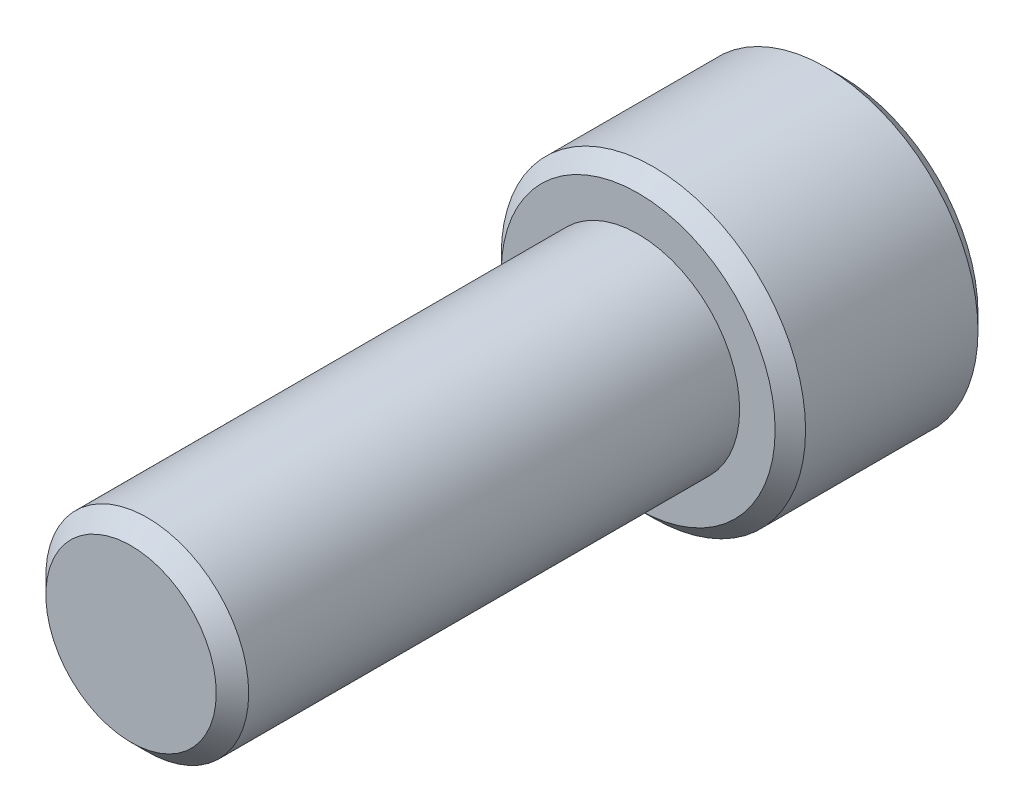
ISO-10303-21;
HEADER;
FILE_DESCRIPTION(('STEP AP214'),'2;1');
FILE_NAME('part.step','',(''),(''),'','','');
FILE_SCHEMA(('AUTOMOTIVE_DESIGN { 1 0 10303 214 1 1 1 1 }'));
ENDSEC;
DATA;
#1=APPLICATION_CONTEXT('core data for automotive mechanical design processes');
#2=APPLICATION_PROTOCOL_DEFINITION('international standard','automotive_design',2000,#1);
#3=PRODUCT_CONTEXT('',#1,'mechanical');
#4=PRODUCT('Part','Part','',(#3));
#5=PRODUCT_RELATED_PRODUCT_CATEGORY('part','',(#4));
#6=PRODUCT_DEFINITION_FORMATION('','',#4);
#7=PRODUCT_DEFINITION_CONTEXT('part definition',#1,'design');
#8=PRODUCT_DEFINITION('design','',#6,#7);
#9=PRODUCT_DEFINITION_SHAPE('','',#8);
#10=(LENGTH_UNIT() NAMED_UNIT(*) SI_UNIT(.MILLI.,.METRE.));
#11=(NAMED_UNIT(*) PLANE_ANGLE_UNIT() SI_UNIT($,.RADIAN.));
#12=(NAMED_UNIT(*) SI_UNIT($,.STERADIAN.) SOLID_ANGLE_UNIT());
#13=UNCERTAINTY_MEASURE_WITH_UNIT(LENGTH_MEASURE(1.E-05),#10,'distance_accuracy_value','');
#14=(GEOMETRIC_REPRESENTATION_CONTEXT(3) GLOBAL_UNCERTAINTY_ASSIGNED_CONTEXT((#13)) GLOBAL_UNIT_ASSIGNED_CONTEXT((#10,
#11,#12)) REPRESENTATION_CONTEXT('',''));
#15=CARTESIAN_POINT('',(0.,0.,0.));
#16=DIRECTION('',(0.,0.,1.));
#17=DIRECTION('',(1.,0.,0.));
#18=AXIS2_PLACEMENT_3D('',#15,#16,#17);
#19=CARTESIAN_POINT('',(0.,0.,-15.875));
#20=DIRECTION('',(0.,0.,1.));
#21=DIRECTION('',(1.,0.,0.));
#22=AXIS2_PLACEMENT_3D('',#19,#20,#21);
#23=CYLINDRICAL_SURFACE('',#22,3.175);
#24=CARTESIAN_POINT('',(0.,0.,-0.508000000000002));
#25=DIRECTION('',(0.,0.,1.));
#26=DIRECTION('',(1.,0.,0.));
#27=AXIS2_PLACEMENT_3D('',#24,#25,#26);
#28=CIRCLE('',#27,3.175);
#29=CARTESIAN_POINT('',(3.175,0.,-0.508000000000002));
#30=VERTEX_POINT('',#29);
#31=EDGE_CURVE('E11',#30,#30,#28,.F.);
#32=ORIENTED_EDGE('',*,*,#31,.T.);
#33=EDGE_LOOP('',(#32));
#34=FACE_BOUND('',#33,.T.);
#35=CARTESIAN_POINT('',(0.,0.,-15.875));
#36=DIRECTION('',(0.,0.,-1.));
#37=DIRECTION('',(-1.,0.,0.));
#38=AXIS2_PLACEMENT_3D('',#35,#36,#37);
#39=CIRCLE('',#38,3.175);
#40=CARTESIAN_POINT('',(-3.175,0.,-15.875));
#41=VERTEX_POINT('',#40);
#42=EDGE_CURVE('E107',#41,#41,#39,.F.);
#43=ORIENTED_EDGE('',*,*,#42,.T.);
#44=EDGE_LOOP('',(#43));
#45=FACE_BOUND('',#44,.T.);
#46=ADVANCED_FACE('F33',(#34,#45),#23,.T.);
#47=CARTESIAN_POINT('',(0.,0.,0.));
#48=DIRECTION('',(0.,0.,1.));
#49=DIRECTION('',(1.,0.,0.));
#50=AXIS2_PLACEMENT_3D('',#47,#48,#49);
#51=PLANE('',#50);
#52=CARTESIAN_POINT('',(0.,0.,0.));
#53=DIRECTION('',(0.,0.,1.));
#54=DIRECTION('',(1.,0.,0.));
#55=AXIS2_PLACEMENT_3D('',#52,#53,#54);
#56=CIRCLE('',#55,2.667);
#57=CARTESIAN_POINT('',(2.667,0.,0.));
#58=VERTEX_POINT('',#57);
#59=EDGE_CURVE('E41',#58,#58,#56,.T.);
#60=ORIENTED_EDGE('',*,*,#59,.T.);
#61=EDGE_LOOP('',(#60));
#62=FACE_BOUND('',#61,.T.);
#63=ADVANCED_FACE('F177',(#62),#51,.T.);
#64=CARTESIAN_POINT('',(0.,0.,-22.225));
#65=DIRECTION('',(0.,0.,1.));
#66=DIRECTION('',(1.,0.,0.));
#67=AXIS2_PLACEMENT_3D('',#64,#65,#66);
#68=CYLINDRICAL_SURFACE('',#67,4.7625);
#69=CARTESIAN_POINT('',(0.,0.,-21.74875));
#70=DIRECTION('',(0.,0.,-1.));
#71=DIRECTION('',(-1.,0.,0.));
#72=AXIS2_PLACEMENT_3D('',#69,#70,#71);
#73=CIRCLE('',#72,4.7625);
#74=CARTESIAN_POINT('',(4.7625,0.,-21.74875));
#75=VERTEX_POINT('',#74);
#76=EDGE_CURVE('E169',#75,#75,#73,.F.);
#77=CARTESIAN_POINT('',(0.,0.,-16.35125));
#78=DIRECTION('',(0.,0.,-1.));
#79=DIRECTION('',(-1.,0.,0.));
#80=AXIS2_PLACEMENT_3D('',#77,#78,#79);
#81=CIRCLE('',#80,4.7625);
#82=CARTESIAN_POINT('',(4.7625,0.,-16.35125));
#83=VERTEX_POINT('',#82);
#84=EDGE_CURVE('E166',#83,#83,#81,.T.);
#85=CARTESIAN_POINT('',(4.7625,0.,-21.74875));
#86=CARTESIAN_POINT('',(4.7625,0.,-21.6925260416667));
#87=CARTESIAN_POINT('',(4.7625,0.,-21.6363020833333));
#88=CARTESIAN_POINT('',(4.7625,0.,-21.5238541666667));
#89=CARTESIAN_POINT('',(4.7625,0.,-21.4676302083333));
#90=CARTESIAN_POINT('',(4.7625,0.,-21.3551822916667));
#91=CARTESIAN_POINT('',(4.7625,0.,-21.2989583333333));
#92=CARTESIAN_POINT('',(4.7625,0.,-21.1865104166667));
#93=CARTESIAN_POINT('',(4.7625,0.,-21.1302864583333));
#94=CARTESIAN_POINT('',(4.7625,0.,-21.0178385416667));
#95=CARTESIAN_POINT('',(4.7625,0.,-20.9616145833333));
#96=CARTESIAN_POINT('',(4.7625,0.,-20.8491666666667));
#97=CARTESIAN_POINT('',(4.7625,0.,-20.7929427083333));
#98=CARTESIAN_POINT('',(4.7625,0.,-20.6804947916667));
#99=CARTESIAN_POINT('',(4.7625,0.,-20.6242708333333));
#100=CARTESIAN_POINT('',(4.7625,0.,-20.5118229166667));
#101=CARTESIAN_POINT('',(4.7625,0.,-20.4555989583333));
#102=CARTESIAN_POINT('',(4.7625,0.,-20.3431510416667));
#103=CARTESIAN_POINT('',(4.7625,0.,-20.2869270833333));
#104=CARTESIAN_POINT('',(4.7625,0.,-20.1744791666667));
#105=CARTESIAN_POINT('',(4.7625,0.,-20.1182552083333));
#106=CARTESIAN_POINT('',(4.7625,0.,-20.0058072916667));
#107=CARTESIAN_POINT('',(4.7625,0.,-19.9495833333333));
#108=CARTESIAN_POINT('',(4.7625,0.,-19.8371354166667));
#109=CARTESIAN_POINT('',(4.7625,0.,-19.7809114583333));
#110=CARTESIAN_POINT('',(4.7625,0.,-19.6684635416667));
#111=CARTESIAN_POINT('',(4.7625,0.,-19.6122395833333));
#112=CARTESIAN_POINT('',(4.7625,0.,-19.4997916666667));
#113=CARTESIAN_POINT('',(4.7625,0.,-19.4435677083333));
#114=CARTESIAN_POINT('',(4.7625,0.,-19.3311197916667));
#115=CARTESIAN_POINT('',(4.7625,0.,-19.2748958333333));
#116=CARTESIAN_POINT('',(4.7625,0.,-19.1624479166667));
#117=CARTESIAN_POINT('',(4.7625,0.,-19.1062239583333));
#118=CARTESIAN_POINT('',(4.7625,0.,-18.9937760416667));
#119=CARTESIAN_POINT('',(4.7625,0.,-18.9375520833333));
#120=CARTESIAN_POINT('',(4.7625,0.,-18.8251041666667));
#121=CARTESIAN_POINT('',(4.7625,0.,-18.7688802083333));
#122=CARTESIAN_POINT('',(4.7625,0.,-18.6564322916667));
#123=CARTESIAN_POINT('',(4.7625,0.,-18.6002083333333));
#124=CARTESIAN_POINT('',(4.7625,0.,-18.4877604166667));
#125=CARTESIAN_POINT('',(4.7625,0.,-18.4315364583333));
#126=CARTESIAN_POINT('',(4.7625,0.,-18.3190885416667));
#127=CARTESIAN_POINT('',(4.7625,0.,-18.2628645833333));
#128=CARTESIAN_POINT('',(4.7625,0.,-18.1504166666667));
#129=CARTESIAN_POINT('',(4.7625,0.,-18.0941927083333));
#130=CARTESIAN_POINT('',(4.7625,0.,-17.9817447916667));
#131=CARTESIAN_POINT('',(4.7625,0.,-17.9255208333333));
#132=CARTESIAN_POINT('',(4.7625,0.,-17.8130729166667));
#133=CARTESIAN_POINT('',(4.7625,0.,-17.7568489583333));
#134=CARTESIAN_POINT('',(4.7625,0.,-17.6444010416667));
#135=CARTESIAN_POINT('',(4.7625,0.,-17.5881770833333));
#136=CARTESIAN_POINT('',(4.7625,0.,-17.4757291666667));
#137=CARTESIAN_POINT('',(4.7625,0.,-17.4195052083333));
#138=CARTESIAN_POINT('',(4.7625,0.,-17.3070572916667));
#139=CARTESIAN_POINT('',(4.7625,0.,-17.2508333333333));
#140=CARTESIAN_POINT('',(4.7625,0.,-17.1383854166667));
#141=CARTESIAN_POINT('',(4.7625,0.,-17.0821614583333));
#142=CARTESIAN_POINT('',(4.7625,0.,-16.9697135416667));
#143=CARTESIAN_POINT('',(4.7625,0.,-16.9134895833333));
#144=CARTESIAN_POINT('',(4.7625,0.,-16.8010416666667));
#145=CARTESIAN_POINT('',(4.7625,0.,-16.7448177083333));
#146=CARTESIAN_POINT('',(4.7625,0.,-16.6323697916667));
#147=CARTESIAN_POINT('',(4.7625,0.,-16.5761458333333));
#148=CARTESIAN_POINT('',(4.7625,0.,-16.4636979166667));
#149=CARTESIAN_POINT('',(4.7625,0.,-16.4074739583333));
#150=CARTESIAN_POINT('',(4.7625,0.,-16.35125));
#151=B_SPLINE_CURVE_WITH_KNOTS('',3,(#85,#86,#87,#88,#89,#90,#91,#92,#93,#94,#95,#96,#97,#98,
#99,#100,#101,#102,#103,#104,#105,#106,#107,#108,#109,#110,#111,#112,#113,#114,#115,#116,#117,
#118,#119,#120,#121,#122,#123,#124,#125,#126,#127,#128,#129,#130,#131,#132,#133,#134,#135,#136,
#137,#138,#139,#140,#141,#142,#143,#144,#145,#146,#147,#148,#149,#150),.UNSPECIFIED.,.F.,.F.,(4,
2,2,2,2,2,2,2,2,2,2,2,2,2,2,2,2,2,2,2,2,2,2,2,2,2,2,2,2,2,2,2,4),(0.,0.168671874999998,
0.337343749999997,0.506015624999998,0.6746875,0.843359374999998,1.01203125,1.180703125,1.349375,
1.518046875,1.68671875,1.855390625,2.0240625,2.192734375,2.36140625,2.530078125,2.69875,
2.867421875,3.03609375,3.204765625,3.3734375,3.542109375,3.71078125,3.879453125,4.048125,
4.216796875,4.38546875,4.554140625,4.7228125,4.891484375,5.06015625,5.228828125,5.3975),.UNSPECIFIED.);
#152=EDGE_CURVE('BSEAM194',#75,#83,#151,.T.);
#153=ORIENTED_EDGE('',*,*,#76,.T.);
#154=ORIENTED_EDGE('',*,*,#84,.T.);
#155=ORIENTED_EDGE('',*,*,#152,.T.);
#156=ORIENTED_EDGE('',*,*,#152,.F.);
#157=EDGE_LOOP('',(#153,#155,#154,#156));
#158=FACE_BOUND('',#157,.T.);
#159=ADVANCED_FACE('F194',(#158),#68,.T.);
#160=CARTESIAN_POINT('',(0.,0.,-22.225));
#161=DIRECTION('',(0.,0.,-1.));
#162=DIRECTION('',(-1.,0.,0.));
#163=AXIS2_PLACEMENT_3D('',#160,#161,#162);
#164=PLANE('',#163);
#165=CARTESIAN_POINT('',(0.,0.,-22.225));
#166=DIRECTION('',(0.,0.,-1.));
#167=DIRECTION('',(-1.,0.,0.));
#168=AXIS2_PLACEMENT_3D('',#165,#166,#167);
#169=CIRCLE('',#168,4.28625);
#170=CARTESIAN_POINT('',(4.28625,0.,-22.225));
#171=VERTEX_POINT('',#170);
#172=EDGE_CURVE('E106',#171,#171,#169,.T.);
#173=ORIENTED_EDGE('',*,*,#172,.T.);
#174=EDGE_LOOP('',(#173));
#175=FACE_BOUND('',#174,.T.);
#176=CARTESIAN_POINT('',(0.,0.,-22.225));
#177=DIRECTION('',(0.,0.,-1.));
#178=DIRECTION('',(-1.,0.,0.));
#179=AXIS2_PLACEMENT_3D('',#176,#177,#178);
#180=CIRCLE('',#179,2.74963065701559);
#181=CARTESIAN_POINT('',(-2.38125,1.37481532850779,-22.225));
#182=VERTEX_POINT('',#181);
#183=CARTESIAN_POINT('',(0.,2.74963065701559,-22.225));
#184=VERTEX_POINT('',#183);
#185=EDGE_CURVE('E87',#182,#184,#180,.T.);
#186=ORIENTED_EDGE('',*,*,#185,.F.);
#187=CARTESIAN_POINT('',(-2.38125,-1.3748153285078,-22.225));
#188=VERTEX_POINT('',#187);
#189=EDGE_CURVE('E47',#188,#182,#180,.T.);
#190=ORIENTED_EDGE('',*,*,#189,.F.);
#191=CARTESIAN_POINT('',(0.,-2.74963065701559,-22.225));
#192=VERTEX_POINT('',#191);
#193=EDGE_CURVE('E401',#192,#188,#180,.T.);
#194=ORIENTED_EDGE('',*,*,#193,.F.);
#195=CARTESIAN_POINT('',(2.38125,-1.3748153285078,-22.225));
#196=VERTEX_POINT('',#195);
#197=EDGE_CURVE('E54',#196,#192,#180,.T.);
#198=ORIENTED_EDGE('',*,*,#197,.F.);
#199=CARTESIAN_POINT('',(2.38125,1.3748153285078,-22.225));
#200=VERTEX_POINT('',#199);
#201=EDGE_CURVE('E128',#200,#196,#180,.T.);
#202=ORIENTED_EDGE('',*,*,#201,.F.);
#203=EDGE_CURVE('E96',#184,#200,#180,.T.);
#204=ORIENTED_EDGE('',*,*,#203,.F.);
#205=EDGE_LOOP('',(#186,#190,#194,#198,#202,#204));
#206=FACE_BOUND('',#205,.T.);
#207=ADVANCED_FACE('F127',(#175,#206),#164,.T.);
#208=CARTESIAN_POINT('',(0.,0.,-15.875));
#209=DIRECTION('',(0.,0.,-1.));
#210=DIRECTION('',(-1.,0.,0.));
#211=AXIS2_PLACEMENT_3D('',#208,#209,#210);
#212=PLANE('',#211);
#213=CARTESIAN_POINT('',(0.,0.,-15.875));
#214=DIRECTION('',(0.,0.,-1.));
#215=DIRECTION('',(-1.,0.,0.));
#216=AXIS2_PLACEMENT_3D('',#213,#214,#215);
#217=CIRCLE('',#216,4.28625);
#218=CARTESIAN_POINT('',(-4.28625,0.,-15.875));
#219=VERTEX_POINT('',#218);
#220=EDGE_CURVE('E172',#219,#219,#217,.F.);
#221=ORIENTED_EDGE('',*,*,#220,.T.);
#222=EDGE_LOOP('',(#221));
#223=FACE_BOUND('',#222,.T.);
#224=ORIENTED_EDGE('',*,*,#42,.F.);
#225=EDGE_LOOP('',(#224));
#226=FACE_BOUND('',#225,.T.);
#227=ADVANCED_FACE('F210',(#223,#226),#212,.F.);
#228=CARTESIAN_POINT('',(0.,0.,-22.225));
#229=DIRECTION('',(0.,0.,-1.));
#230=DIRECTION('',(-1.,0.,0.));
#231=AXIS2_PLACEMENT_3D('',#228,#229,#230);
#232=CONICAL_SURFACE('',#231,2.74963065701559,0.78539816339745);
#233=ORIENTED_EDGE('',*,*,#203,.T.);
#234=CARTESIAN_POINT('',(-0.000199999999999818,2.74974612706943,-22.2251154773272));
#235=CARTESIAN_POINT('',(0.0816567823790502,2.70248609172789,-22.1778948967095));
#236=CARTESIAN_POINT('',(0.16488233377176,2.65443579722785,-22.1334475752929));
#237=CARTESIAN_POINT('',(0.33458848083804,2.556455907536,-22.0520654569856));
#238=CARTESIAN_POINT('',(0.421085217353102,2.50651699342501,-22.0151759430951));
#239=CARTESIAN_POINT('',(0.595501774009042,2.40581754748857,-21.9519834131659));
#240=CARTESIAN_POINT('',(0.683377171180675,2.35508266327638,-21.9255215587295));
#241=CARTESIAN_POINT('',(0.861062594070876,2.25249593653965,-21.8847515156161));
#242=CARTESIAN_POINT('',(0.950867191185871,2.20064722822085,-21.8704128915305));
#243=CARTESIAN_POINT('',(1.10563960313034,2.11128933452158,-21.8574757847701));
#244=CARTESIAN_POINT('',(1.17040744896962,2.07389560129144,-21.8555606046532));
#245=CARTESIAN_POINT('',(1.29983727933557,1.99916925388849,-21.8587866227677));
#246=CARTESIAN_POINT('',(1.36449921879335,1.96183666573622,-21.8639302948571));
#247=CARTESIAN_POINT('',(1.4932125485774,1.88752399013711,-21.8809813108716));
#248=CARTESIAN_POINT('',(1.55726317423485,1.85054434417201,-21.8928962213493));
#249=CARTESIAN_POINT('',(1.68425683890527,1.77722451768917,-21.922835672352));
#250=CARTESIAN_POINT('',(1.74719996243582,1.74088428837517,-21.9408597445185));
#251=CARTESIAN_POINT('',(1.90842615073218,1.64780030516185,-21.9943688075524));
#252=CARTESIAN_POINT('',(2.00570949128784,1.59163374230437,-22.0338874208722));
#253=CARTESIAN_POINT('',(2.14875606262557,1.50904576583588,-22.1006003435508));
#254=CARTESIAN_POINT('',(2.19589628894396,1.4818293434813,-22.1240402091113));
#255=CARTESIAN_POINT('',(2.28930352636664,1.42790064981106,-22.1730566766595));
#256=CARTESIAN_POINT('',(2.33557105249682,1.40118808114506,-22.1986319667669));
#257=CARTESIAN_POINT('',(2.38145,1.37469985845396,-22.2251154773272));
#258=B_SPLINE_CURVE_WITH_KNOTS('',3,(#234,#235,#236,#237,#238,#239,#240,#241,#242,#243,#244,
#245,#246,#247,#248,#249,#250,#251,#252,#253,#254,#255,#256,#257),.UNSPECIFIED.,.F.,.F.,(4,2,2,
2,2,2,2,2,2,2,2,4),(0.,0.317196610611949,0.636241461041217,0.950218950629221,1.26340583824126,
1.48752413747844,1.71172100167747,1.93616888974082,2.16059957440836,2.51709639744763,
2.69486147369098,2.87251813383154),.UNSPECIFIED.);
#259=EDGE_CURVE('E101',#184,#200,#258,.T.);
#260=ORIENTED_EDGE('',*,*,#259,.F.);
#261=EDGE_LOOP('',(#233,#260));
#262=FACE_BOUND('',#261,.T.);
#263=ADVANCED_FACE('F102',(#262),#232,.F.);
#264=ORIENTED_EDGE('',*,*,#201,.T.);
#265=CARTESIAN_POINT('',(2.38125,-2.74194290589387,-23.1069808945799));
#266=CARTESIAN_POINT('',(2.38125,-2.6751796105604,-23.0565846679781));
#267=CARTESIAN_POINT('',(2.38125,-2.60804251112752,-23.0066755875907));
#268=CARTESIAN_POINT('',(2.38125,-2.47287325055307,-22.9080498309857));
#269=CARTESIAN_POINT('',(2.38125,-2.40484086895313,-22.8593334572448));
#270=CARTESIAN_POINT('',(2.38125,-2.26723593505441,-22.7629648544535));
#271=CARTESIAN_POINT('',(2.38125,-2.1976555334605,-22.7153237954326));
#272=CARTESIAN_POINT('',(2.38125,-2.05731367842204,-22.6218199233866));
#273=CARTESIAN_POINT('',(2.38125,-1.98655230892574,-22.5759569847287));
#274=CARTESIAN_POINT('',(2.38125,-1.83957751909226,-22.4838459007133));
#275=CARTESIAN_POINT('',(2.38125,-1.76328361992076,-22.4377255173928));
#276=CARTESIAN_POINT('',(2.38125,-1.6089135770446,-22.3485183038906));
#277=CARTESIAN_POINT('',(2.38125,-1.53083712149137,-22.3054320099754));
#278=CARTESIAN_POINT('',(2.38125,-1.37291620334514,-22.2232265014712));
#279=CARTESIAN_POINT('',(2.38125,-1.29307799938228,-22.1840953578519));
#280=CARTESIAN_POINT('',(2.38125,-1.13121425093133,-22.1106679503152));
#281=CARTESIAN_POINT('',(2.38125,-1.04918943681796,-22.0763700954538));
#282=CARTESIAN_POINT('',(2.38125,-0.889535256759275,-22.0163546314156));
#283=CARTESIAN_POINT('',(2.38125,-0.812083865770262,-21.990168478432));
#284=CARTESIAN_POINT('',(2.38125,-0.655316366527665,-21.9440097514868));
#285=CARTESIAN_POINT('',(2.38125,-0.576000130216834,-21.9240376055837));
#286=CARTESIAN_POINT('',(2.38125,-0.417295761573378,-21.8916821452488));
#287=CARTESIAN_POINT('',(2.38125,-0.337934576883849,-21.8791688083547));
#288=CARTESIAN_POINT('',(2.38125,-0.178363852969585,-21.8619738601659));
#289=CARTESIAN_POINT('',(2.38125,-0.0981544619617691,-21.8572909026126));
#290=CARTESIAN_POINT('',(2.38125,0.059418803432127,-21.8561044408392));
#291=CARTESIAN_POINT('',(2.38125,0.136780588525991,-21.8593110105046));
#292=CARTESIAN_POINT('',(2.38125,0.290840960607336,-21.8730870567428));
#293=CARTESIAN_POINT('',(2.38125,0.367539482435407,-21.8836572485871));
#294=CARTESIAN_POINT('',(2.38125,0.521017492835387,-21.9117628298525));
#295=CARTESIAN_POINT('',(2.38125,0.597774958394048,-21.9294167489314));
#296=CARTESIAN_POINT('',(2.38125,0.74960981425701,-21.9707513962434));
#297=CARTESIAN_POINT('',(2.38125,0.824687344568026,-21.9944316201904));
#298=CARTESIAN_POINT('',(2.38125,1.06107814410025,-22.077894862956));
#299=CARTESIAN_POINT('',(2.38125,1.2190478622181,-22.1471839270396));
#300=CARTESIAN_POINT('',(2.38125,1.45021000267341,-22.2626640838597));
#301=CARTESIAN_POINT('',(2.38125,1.52644290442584,-22.3031730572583));
#302=CARTESIAN_POINT('',(2.38125,1.67717618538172,-22.3873026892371));
#303=CARTESIAN_POINT('',(2.38125,1.75167687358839,-22.4309227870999));
#304=CARTESIAN_POINT('',(2.38125,1.89548152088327,-22.518412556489));
#305=CARTESIAN_POINT('',(2.38125,1.96485959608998,-22.5621617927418));
#306=CARTESIAN_POINT('',(2.38125,2.10242624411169,-22.6515011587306));
#307=CARTESIAN_POINT('',(2.38125,2.17061472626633,-22.697091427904));
#308=CARTESIAN_POINT('',(2.38125,2.30540317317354,-22.7894060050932));
#309=CARTESIAN_POINT('',(2.38125,2.37201154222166,-22.8361180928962));
#310=CARTESIAN_POINT('',(2.38125,2.50431800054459,-22.9307775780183));
#311=CARTESIAN_POINT('',(2.38125,2.57001633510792,-22.9787246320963));
#312=CARTESIAN_POINT('',(2.38125,2.63533378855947,-23.0271767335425));
#313=B_SPLINE_CURVE_WITH_KNOTS('',3,(#265,#266,#267,#268,#269,#270,#271,#272,#273,#274,#275,
#276,#277,#278,#279,#280,#281,#282,#283,#284,#285,#286,#287,#288,#289,#290,#291,#292,#293,#294,
#295,#296,#297,#298,#299,#300,#301,#302,#303,#304,#305,#306,#307,#308,#309,#310,#311,#312),
.UNSPECIFIED.,.F.,.F.,(4,2,2,2,2,2,2,2,2,2,2,2,2,2,2,2,2,2,2,2,2,2,2,4),(0.,0.250951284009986,
0.501965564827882,0.754924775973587,1.00786608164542,1.27526207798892,1.54270521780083,
1.80931602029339,2.07583885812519,2.32089852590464,2.56597507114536,2.80664400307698,
3.04727155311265,3.27918940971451,3.51112979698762,3.74712477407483,3.98310000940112,
4.49898139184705,4.75794323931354,5.01685853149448,5.26288960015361,5.50893933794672,
5.75299038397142,5.9969743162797),.UNSPECIFIED.);
#314=EDGE_CURVE('E95',#200,#196,#313,.F.);
#315=ORIENTED_EDGE('',*,*,#314,.F.);
#316=EDGE_LOOP('',(#264,#315));
#317=FACE_BOUND('',#316,.T.);
#318=ADVANCED_FACE('F277',(#317),#232,.F.);
#319=ORIENTED_EDGE('',*,*,#197,.T.);
#320=CARTESIAN_POINT('',(2.38145,-1.37469985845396,-22.2251154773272));
#321=CARTESIAN_POINT('',(2.29959321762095,-1.4219598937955,-22.1778948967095));
#322=CARTESIAN_POINT('',(2.21636766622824,-1.47001018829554,-22.1334475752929));
#323=CARTESIAN_POINT('',(2.04666151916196,-1.56799007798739,-22.0520654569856));
#324=CARTESIAN_POINT('',(1.9601647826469,-1.61792899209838,-22.0151759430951));
#325=CARTESIAN_POINT('',(1.78574822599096,-1.71862843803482,-21.9519834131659));
#326=CARTESIAN_POINT('',(1.69787282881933,-1.769363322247,-21.9255215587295));
#327=CARTESIAN_POINT('',(1.52018740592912,-1.87195004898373,-21.8847515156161));
#328=CARTESIAN_POINT('',(1.43038280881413,-1.92379875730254,-21.8704128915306));
#329=CARTESIAN_POINT('',(1.27561039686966,-2.01315665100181,-21.8574757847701));
#330=CARTESIAN_POINT('',(1.21084255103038,-2.05055038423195,-21.8555606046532));
#331=CARTESIAN_POINT('',(1.08141272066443,-2.1252767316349,-21.8587866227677));
#332=CARTESIAN_POINT('',(1.01675078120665,-2.16260931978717,-21.8639302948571));
#333=CARTESIAN_POINT('',(0.888037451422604,-2.23692199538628,-21.8809813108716));
#334=CARTESIAN_POINT('',(0.823986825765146,-2.27390164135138,-21.8928962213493));
#335=CARTESIAN_POINT('',(0.696993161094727,-2.34722146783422,-21.922835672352));
#336=CARTESIAN_POINT('',(0.634050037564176,-2.38356169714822,-21.9408597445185));
#337=CARTESIAN_POINT('',(0.472823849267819,-2.47664568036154,-21.9943688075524));
#338=CARTESIAN_POINT('',(0.37554050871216,-2.53281224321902,-22.0338874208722));
#339=CARTESIAN_POINT('',(0.232493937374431,-2.61540021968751,-22.1006003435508));
#340=CARTESIAN_POINT('',(0.185353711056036,-2.6426166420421,-22.1240402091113));
#341=CARTESIAN_POINT('',(0.0919464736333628,-2.69654533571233,-22.1730566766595));
#342=CARTESIAN_POINT('',(0.0456789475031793,-2.72325790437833,-22.1986319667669));
#343=CARTESIAN_POINT('',(-0.000199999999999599,-2.74974612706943,-22.2251154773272));
#344=B_SPLINE_CURVE_WITH_KNOTS('',3,(#320,#321,#322,#323,#324,#325,#326,#327,#328,#329,#330,
#331,#332,#333,#334,#335,#336,#337,#338,#339,#340,#341,#342,#343),.UNSPECIFIED.,.F.,.F.,(4,2,2,
2,2,2,2,2,2,2,2,4),(0.,0.31719661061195,0.636241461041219,0.950218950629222,1.26340583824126,
1.48752413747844,1.71172100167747,1.93616888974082,2.16059957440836,2.51709639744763,
2.69486147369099,2.87251813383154),.UNSPECIFIED.);
#345=EDGE_CURVE('E137',#196,#192,#344,.T.);
#346=ORIENTED_EDGE('',*,*,#345,.F.);
#347=EDGE_LOOP('',(#319,#346));
#348=FACE_BOUND('',#347,.T.);
#349=ADVANCED_FACE('F269',(#348),#232,.F.);
#350=ORIENTED_EDGE('',*,*,#193,.T.);
#351=CARTESIAN_POINT('',(0.000200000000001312,-2.74974612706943,-22.2251154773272));
#352=CARTESIAN_POINT('',(-0.0816567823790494,-2.70248609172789,-22.1778948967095));
#353=CARTESIAN_POINT('',(-0.164882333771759,-2.65443579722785,-22.1334475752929));
#354=CARTESIAN_POINT('',(-0.334588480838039,-2.556455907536,-22.0520654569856));
#355=CARTESIAN_POINT('',(-0.421085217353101,-2.50651699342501,-22.0151759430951));
#356=CARTESIAN_POINT('',(-0.595501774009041,-2.40581754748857,-21.9519834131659));
#357=CARTESIAN_POINT('',(-0.683377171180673,-2.35508266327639,-21.9255215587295));
#358=CARTESIAN_POINT('',(-0.861062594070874,-2.25249593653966,-21.8847515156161));
#359=CARTESIAN_POINT('',(-0.95086719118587,-2.20064722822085,-21.8704128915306));
#360=CARTESIAN_POINT('',(-1.10563960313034,-2.11128933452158,-21.8574757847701));
#361=CARTESIAN_POINT('',(-1.17040744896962,-2.07389560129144,-21.8555606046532));
#362=CARTESIAN_POINT('',(-1.29983727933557,-1.99916925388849,-21.8587866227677));
#363=CARTESIAN_POINT('',(-1.36449921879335,-1.96183666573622,-21.8639302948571));
#364=CARTESIAN_POINT('',(-1.4932125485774,-1.88752399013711,-21.8809813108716));
#365=CARTESIAN_POINT('',(-1.55726317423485,-1.85054434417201,-21.8928962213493));
#366=CARTESIAN_POINT('',(-1.68425683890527,-1.77722451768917,-21.922835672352));
#367=CARTESIAN_POINT('',(-1.74719996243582,-1.74088428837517,-21.9408597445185));
#368=CARTESIAN_POINT('',(-1.90842615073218,-1.64780030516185,-21.9943688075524));
#369=CARTESIAN_POINT('',(-2.00570949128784,-1.59163374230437,-22.0338874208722));
#370=CARTESIAN_POINT('',(-2.14875606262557,-1.50904576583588,-22.1006003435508));
#371=CARTESIAN_POINT('',(-2.19589628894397,-1.48182934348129,-22.1240402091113));
#372=CARTESIAN_POINT('',(-2.28930352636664,-1.42790064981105,-22.1730566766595));
#373=CARTESIAN_POINT('',(-2.33557105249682,-1.40118808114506,-22.1986319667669));
#374=CARTESIAN_POINT('',(-2.38145,-1.37469985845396,-22.2251154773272));
#375=B_SPLINE_CURVE_WITH_KNOTS('',3,(#351,#352,#353,#354,#355,#356,#357,#358,#359,#360,#361,
#362,#363,#364,#365,#366,#367,#368,#369,#370,#371,#372,#373,#374),.UNSPECIFIED.,.F.,.F.,(4,2,2,
2,2,2,2,2,2,2,2,4),(0.,0.317196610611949,0.636241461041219,0.950218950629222,1.26340583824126,
1.48752413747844,1.71172100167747,1.93616888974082,2.16059957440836,2.51709639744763,
2.69486147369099,2.87251813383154),.UNSPECIFIED.);
#376=EDGE_CURVE('E364',#192,#188,#375,.T.);
#377=ORIENTED_EDGE('',*,*,#376,.F.);
#378=EDGE_LOOP('',(#350,#377));
#379=FACE_BOUND('',#378,.T.);
#380=ADVANCED_FACE('F262',(#379),#232,.F.);
#381=ORIENTED_EDGE('',*,*,#189,.T.);
#382=CARTESIAN_POINT('',(-2.38125,-2.74194290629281,-23.1069808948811));
#383=CARTESIAN_POINT('',(-2.38125,-2.67517961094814,-23.0565846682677));
#384=CARTESIAN_POINT('',(-2.38125,-2.60804251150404,-23.0066755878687));
#385=CARTESIAN_POINT('',(-2.38125,-2.47287325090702,-22.9080498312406));
#386=CARTESIAN_POINT('',(-2.38125,-2.40484086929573,-22.8593334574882));
#387=CARTESIAN_POINT('',(-2.38125,-2.26723593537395,-22.7629648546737));
#388=CARTESIAN_POINT('',(-2.38125,-2.1976555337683,-22.7153237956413));
#389=CARTESIAN_POINT('',(-2.38125,-2.05731367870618,-22.6218199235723));
#390=CARTESIAN_POINT('',(-2.38125,-1.98655230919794,-22.575956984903));
#391=CARTESIAN_POINT('',(-2.38125,-1.83957751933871,-22.4838459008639));
#392=CARTESIAN_POINT('',(-2.38125,-1.76328362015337,-22.4377255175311));
#393=CARTESIAN_POINT('',(-2.38125,-1.60891357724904,-22.3485183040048));
#394=CARTESIAN_POINT('',(-2.38125,-1.53083712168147,-22.305432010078));
#395=CARTESIAN_POINT('',(-2.38125,-1.37291620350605,-22.2232265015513));
#396=CARTESIAN_POINT('',(-2.38125,-1.29307799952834,-22.1840953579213));
#397=CARTESIAN_POINT('',(-2.38125,-1.13121425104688,-22.1106679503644));
#398=CARTESIAN_POINT('',(-2.38125,-1.04918943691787,-22.0763700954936));
#399=CARTESIAN_POINT('',(-2.38125,-0.889535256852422,-22.0163546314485));
#400=CARTESIAN_POINT('',(-2.38125,-0.812083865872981,-21.9901684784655));
#401=CARTESIAN_POINT('',(-2.38125,-0.655316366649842,-21.9440097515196));
#402=CARTESIAN_POINT('',(-2.38125,-0.576000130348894,-21.9240376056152));
#403=CARTESIAN_POINT('',(-2.38125,-0.41729576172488,-21.8916821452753));
#404=CARTESIAN_POINT('',(-2.38125,-0.337934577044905,-21.8791688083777));
#405=CARTESIAN_POINT('',(-2.38125,-0.178363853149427,-21.8619738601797));
#406=CARTESIAN_POINT('',(-2.38125,-0.0981544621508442,-21.8572909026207));
#407=CARTESIAN_POINT('',(-2.38125,0.0594188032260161,-21.8561044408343));
#408=CARTESIAN_POINT('',(-2.38125,0.136780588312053,-21.8593110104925));
#409=CARTESIAN_POINT('',(-2.38125,0.290840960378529,-21.8730870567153));
#410=CARTESIAN_POINT('',(-2.38125,0.367539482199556,-21.8836572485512));
#411=CARTESIAN_POINT('',(-2.38125,0.521017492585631,-21.9117628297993));
#412=CARTESIAN_POINT('',(-2.38125,0.597774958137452,-21.9294167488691));
#413=CARTESIAN_POINT('',(-2.38125,0.749609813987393,-21.9707513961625));
#414=CARTESIAN_POINT('',(-2.38125,0.82468734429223,-21.9944316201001));
#415=CARTESIAN_POINT('',(-2.38125,1.0610781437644,-22.0778948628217));
#416=CARTESIAN_POINT('',(-2.38125,1.21904786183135,-22.1471839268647));
#417=CARTESIAN_POINT('',(-2.38125,1.45021000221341,-22.2626640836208));
#418=CARTESIAN_POINT('',(-2.38125,1.52644290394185,-22.3031730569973));
#419=CARTESIAN_POINT('',(-2.38125,1.67717618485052,-22.3873026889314));
#420=CARTESIAN_POINT('',(-2.38125,1.75167687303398,-22.4309227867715));
#421=CARTESIAN_POINT('',(-2.38125,1.89548152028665,-22.5184125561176));
#422=CARTESIAN_POINT('',(-2.38125,1.96485959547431,-22.56216179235));
#423=CARTESIAN_POINT('',(-2.38125,2.10242624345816,-22.6515011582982));
#424=CARTESIAN_POINT('',(-2.38125,2.17061472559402,-22.6970914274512));
#425=CARTESIAN_POINT('',(-2.38125,2.3054031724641,-22.7894060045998));
#426=CARTESIAN_POINT('',(-2.38125,2.37201154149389,-22.8361180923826));
#427=CARTESIAN_POINT('',(-2.38125,2.50431799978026,-22.9307775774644));
#428=CARTESIAN_POINT('',(-2.38125,2.57001633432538,-22.9787246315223));
#429=CARTESIAN_POINT('',(-2.38125,2.63533378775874,-23.0271767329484));
#430=B_SPLINE_CURVE_WITH_KNOTS('',3,(#382,#383,#384,#385,#386,#387,#388,#389,#390,#391,#392,
#393,#394,#395,#396,#397,#398,#399,#400,#401,#402,#403,#404,#405,#406,#407,#408,#409,#410,#411,
#412,#413,#414,#415,#416,#417,#418,#419,#420,#421,#422,#423,#424,#425,#426,#427,#428,#429),
.UNSPECIFIED.,.F.,.F.,(4,2,2,2,2,2,2,2,2,2,2,2,2,2,2,2,2,2,2,2,2,2,2,4),(0.,0.250951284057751,
0.501965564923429,0.754924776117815,1.00786608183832,1.2752620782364,1.54270521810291,
1.80931602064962,2.0758388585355,2.32089852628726,2.56597507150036,2.80664400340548,
3.04727155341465,3.27918940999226,3.51112979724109,3.74712477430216,3.98310000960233,
4.49898139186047,4.75794323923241,5.01685853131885,5.26288959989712,5.50893933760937,
5.7529903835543,5.99697431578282),.UNSPECIFIED.);
#431=EDGE_CURVE('E117',#188,#182,#430,.T.);
#432=ORIENTED_EDGE('',*,*,#431,.F.);
#433=EDGE_LOOP('',(#381,#432));
#434=FACE_BOUND('',#433,.T.);
#435=ADVANCED_FACE('F254',(#434),#232,.F.);
#436=ORIENTED_EDGE('',*,*,#185,.T.);
#437=CARTESIAN_POINT('',(-2.38145,1.37469985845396,-22.2251154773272));
#438=CARTESIAN_POINT('',(-2.29959321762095,1.4219598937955,-22.1778948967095));
#439=CARTESIAN_POINT('',(-2.21636766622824,1.47001018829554,-22.1334475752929));
#440=CARTESIAN_POINT('',(-2.04666151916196,1.56799007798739,-22.0520654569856));
#441=CARTESIAN_POINT('',(-1.9601647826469,1.61792899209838,-22.0151759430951));
#442=CARTESIAN_POINT('',(-1.78574822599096,1.71862843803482,-21.9519834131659));
#443=CARTESIAN_POINT('',(-1.69787282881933,1.769363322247,-21.9255215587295));
#444=CARTESIAN_POINT('',(-1.52018740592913,1.87195004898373,-21.8847515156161));
#445=CARTESIAN_POINT('',(-1.43038280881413,1.92379875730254,-21.8704128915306));
#446=CARTESIAN_POINT('',(-1.27561039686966,2.01315665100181,-21.8574757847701));
#447=CARTESIAN_POINT('',(-1.21084255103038,2.05055038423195,-21.8555606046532));
#448=CARTESIAN_POINT('',(-1.08141272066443,2.1252767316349,-21.8587866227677));
#449=CARTESIAN_POINT('',(-1.01675078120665,2.16260931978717,-21.8639302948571));
#450=CARTESIAN_POINT('',(-0.888037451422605,2.23692199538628,-21.8809813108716));
#451=CARTESIAN_POINT('',(-0.823986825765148,2.27390164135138,-21.8928962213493));
#452=CARTESIAN_POINT('',(-0.696993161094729,2.34722146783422,-21.922835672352));
#453=CARTESIAN_POINT('',(-0.634050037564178,2.38356169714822,-21.9408597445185));
#454=CARTESIAN_POINT('',(-0.47282384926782,2.47664568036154,-21.9943688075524));
#455=CARTESIAN_POINT('',(-0.375540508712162,2.53281224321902,-22.0338874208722));
#456=CARTESIAN_POINT('',(-0.232493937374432,2.61540021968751,-22.1006003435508));
#457=CARTESIAN_POINT('',(-0.185353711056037,2.64261664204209,-22.1240402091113));
#458=CARTESIAN_POINT('',(-0.0919464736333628,2.69654533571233,-22.1730566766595));
#459=CARTESIAN_POINT('',(-0.0456789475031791,2.72325790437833,-22.1986319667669));
#460=CARTESIAN_POINT('',(0.000199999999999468,2.74974612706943,-22.2251154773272));
#461=B_SPLINE_CURVE_WITH_KNOTS('',3,(#437,#438,#439,#440,#441,#442,#443,#444,#445,#446,#447,
#448,#449,#450,#451,#452,#453,#454,#455,#456,#457,#458,#459,#460),.UNSPECIFIED.,.F.,.F.,(4,2,2,
2,2,2,2,2,2,2,2,4),(0.,0.317196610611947,0.636241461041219,0.950218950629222,1.26340583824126,
1.48752413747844,1.71172100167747,1.93616888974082,2.16059957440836,2.51709639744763,
2.69486147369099,2.87251813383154),.UNSPECIFIED.);
#462=EDGE_CURVE('E91',#182,#184,#461,.T.);
#463=ORIENTED_EDGE('',*,*,#462,.F.);
#464=EDGE_LOOP('',(#436,#463));
#465=FACE_BOUND('',#464,.T.);
#466=ADVANCED_FACE('F89',(#465),#232,.F.);
#467=CARTESIAN_POINT('',(2.38125,4.12444598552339,-18.653125));
#468=DIRECTION('',(0.,0.,-1.));
#469=DIRECTION('',(-1.,0.,0.));
#470=AXIS2_PLACEMENT_3D('',#467,#468,#469);
#471=PLANE('',#470);
#472=DIRECTION('',(0.866025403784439,0.5,0.));
#473=VECTOR('',#472,1.);
#474=CARTESIAN_POINT('',(-2.38125,1.3748153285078,-18.653125));
#475=LINE('',#474,#473);
#476=CARTESIAN_POINT('',(-2.38125,1.3748153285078,-18.653125));
#477=VERTEX_POINT('',#476);
#478=CARTESIAN_POINT('',(0.,2.74963065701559,-18.653125));
#479=VERTEX_POINT('',#478);
#480=EDGE_CURVE('E116',#477,#479,#475,.T.);
#481=ORIENTED_EDGE('',*,*,#480,.T.);
#482=DIRECTION('',(0.866025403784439,-0.5,0.));
#483=VECTOR('',#482,1.);
#484=CARTESIAN_POINT('',(0.,2.74963065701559,-18.653125));
#485=LINE('',#484,#483);
#486=CARTESIAN_POINT('',(2.38125,1.3748153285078,-18.653125));
#487=VERTEX_POINT('',#486);
#488=EDGE_CURVE('E121',#479,#487,#485,.T.);
#489=ORIENTED_EDGE('',*,*,#488,.T.);
#490=DIRECTION('',(0.,-1.,0.));
#491=VECTOR('',#490,1.);
#492=CARTESIAN_POINT('',(2.38125,1.3748153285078,-18.653125));
#493=LINE('',#492,#491);
#494=CARTESIAN_POINT('',(2.38125,-1.3748153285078,-18.653125));
#495=VERTEX_POINT('',#494);
#496=EDGE_CURVE('E374',#487,#495,#493,.T.);
#497=ORIENTED_EDGE('',*,*,#496,.T.);
#498=DIRECTION('',(-0.866025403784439,-0.5,0.));
#499=VECTOR('',#498,1.);
#500=CARTESIAN_POINT('',(2.38125,-1.3748153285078,-18.653125));
#501=LINE('',#500,#499);
#502=CARTESIAN_POINT('',(0.,-2.74963065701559,-18.653125));
#503=VERTEX_POINT('',#502);
#504=EDGE_CURVE('E377',#495,#503,#501,.T.);
#505=ORIENTED_EDGE('',*,*,#504,.T.);
#506=DIRECTION('',(-0.866025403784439,0.5,0.));
#507=VECTOR('',#506,1.);
#508=CARTESIAN_POINT('',(0.,-2.74963065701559,-18.653125));
#509=LINE('',#508,#507);
#510=CARTESIAN_POINT('',(-2.38125,-1.3748153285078,-18.653125));
#511=VERTEX_POINT('',#510);
#512=EDGE_CURVE('E380',#503,#511,#509,.T.);
#513=ORIENTED_EDGE('',*,*,#512,.T.);
#514=DIRECTION('',(0.,1.,0.));
#515=VECTOR('',#514,1.);
#516=CARTESIAN_POINT('',(-2.38125,-1.3748153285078,-18.653125));
#517=LINE('',#516,#515);
#518=EDGE_CURVE('E124',#511,#477,#517,.T.);
#519=ORIENTED_EDGE('',*,*,#518,.T.);
#520=EDGE_LOOP('',(#481,#489,#497,#505,#513,#519));
#521=FACE_BOUND('',#520,.T.);
#522=ADVANCED_FACE('F156',(#521),#471,.T.);
#523=CARTESIAN_POINT('',(0.,2.74963065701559,-18.653125));
#524=DIRECTION('',(0.5,0.866025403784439,0.));
#525=DIRECTION('',(-0.866025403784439,0.5,0.));
#526=AXIS2_PLACEMENT_3D('',#523,#524,#525);
#527=PLANE('',#526);
#528=DIRECTION('',(0.,0.,-1.));
#529=VECTOR('',#528,1.);
#530=CARTESIAN_POINT('',(0.,2.74963065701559,-18.653125));
#531=LINE('',#530,#529);
#532=EDGE_CURVE('E113',#479,#184,#531,.T.);
#533=ORIENTED_EDGE('',*,*,#532,.T.);
#534=ORIENTED_EDGE('',*,*,#259,.T.);
#535=DIRECTION('',(0.,0.,-1.));
#536=VECTOR('',#535,1.);
#537=CARTESIAN_POINT('',(2.38125,1.3748153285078,-18.653125));
#538=LINE('',#537,#536);
#539=EDGE_CURVE('E123',#487,#200,#538,.T.);
#540=ORIENTED_EDGE('',*,*,#539,.F.);
#541=ORIENTED_EDGE('',*,*,#488,.F.);
#542=EDGE_LOOP('',(#533,#534,#540,#541));
#543=FACE_BOUND('',#542,.T.);
#544=ADVANCED_FACE('F119',(#543),#527,.F.);
#545=CARTESIAN_POINT('',(2.38125,1.3748153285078,-18.653125));
#546=DIRECTION('',(1.,0.,0.));
#547=DIRECTION('',(0.,0.,-1.));
#548=AXIS2_PLACEMENT_3D('',#545,#546,#547);
#549=PLANE('',#548);
#550=ORIENTED_EDGE('',*,*,#539,.T.);
#551=ORIENTED_EDGE('',*,*,#314,.T.);
#552=DIRECTION('',(0.,0.,-1.));
#553=VECTOR('',#552,1.);
#554=CARTESIAN_POINT('',(2.38125,-1.3748153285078,-18.653125));
#555=LINE('',#554,#553);
#556=EDGE_CURVE('E391',#495,#196,#555,.T.);
#557=ORIENTED_EDGE('',*,*,#556,.F.);
#558=ORIENTED_EDGE('',*,*,#496,.F.);
#559=EDGE_LOOP('',(#550,#551,#557,#558));
#560=FACE_BOUND('',#559,.T.);
#561=ADVANCED_FACE('F145',(#560),#549,.F.);
#562=CARTESIAN_POINT('',(2.38125,-1.3748153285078,-18.653125));
#563=DIRECTION('',(0.5,-0.866025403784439,0.));
#564=DIRECTION('',(0.866025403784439,0.5,0.));
#565=AXIS2_PLACEMENT_3D('',#562,#563,#564);
#566=PLANE('',#565);
#567=ORIENTED_EDGE('',*,*,#556,.T.);
#568=ORIENTED_EDGE('',*,*,#345,.T.);
#569=DIRECTION('',(0.,0.,-1.));
#570=VECTOR('',#569,1.);
#571=CARTESIAN_POINT('',(0.,-2.74963065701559,-18.653125));
#572=LINE('',#571,#570);
#573=EDGE_CURVE('E388',#503,#192,#572,.T.);
#574=ORIENTED_EDGE('',*,*,#573,.F.);
#575=ORIENTED_EDGE('',*,*,#504,.F.);
#576=EDGE_LOOP('',(#567,#568,#574,#575));
#577=FACE_BOUND('',#576,.T.);
#578=ADVANCED_FACE('F149',(#577),#566,.F.);
#579=CARTESIAN_POINT('',(0.,-2.74963065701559,-18.653125));
#580=DIRECTION('',(-0.5,-0.866025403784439,0.));
#581=DIRECTION('',(0.866025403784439,-0.5,0.));
#582=AXIS2_PLACEMENT_3D('',#579,#580,#581);
#583=PLANE('',#582);
#584=ORIENTED_EDGE('',*,*,#573,.T.);
#585=ORIENTED_EDGE('',*,*,#376,.T.);
#586=DIRECTION('',(0.,0.,-1.));
#587=VECTOR('',#586,1.);
#588=CARTESIAN_POINT('',(-2.38125,-1.3748153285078,-18.653125));
#589=LINE('',#588,#587);
#590=EDGE_CURVE('E386',#511,#188,#589,.T.);
#591=ORIENTED_EDGE('',*,*,#590,.F.);
#592=ORIENTED_EDGE('',*,*,#512,.F.);
#593=EDGE_LOOP('',(#584,#585,#591,#592));
#594=FACE_BOUND('',#593,.T.);
#595=ADVANCED_FACE('F313',(#594),#583,.F.);
#596=CARTESIAN_POINT('',(-2.38125,-1.3748153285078,-18.653125));
#597=DIRECTION('',(-1.,0.,0.));
#598=DIRECTION('',(0.,-1.,0.));
#599=AXIS2_PLACEMENT_3D('',#596,#597,#598);
#600=PLANE('',#599);
#601=ORIENTED_EDGE('',*,*,#590,.T.);
#602=ORIENTED_EDGE('',*,*,#431,.T.);
#603=DIRECTION('',(0.,0.,-1.));
#604=VECTOR('',#603,1.);
#605=CARTESIAN_POINT('',(-2.38125,1.3748153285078,-18.653125));
#606=LINE('',#605,#604);
#607=EDGE_CURVE('E115',#477,#182,#606,.T.);
#608=ORIENTED_EDGE('',*,*,#607,.F.);
#609=ORIENTED_EDGE('',*,*,#518,.F.);
#610=EDGE_LOOP('',(#601,#602,#608,#609));
#611=FACE_BOUND('',#610,.T.);
#612=ADVANCED_FACE('F204',(#611),#600,.F.);
#613=CARTESIAN_POINT('',(-2.38125,1.3748153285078,-18.653125));
#614=DIRECTION('',(-0.5,0.866025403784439,0.));
#615=DIRECTION('',(-0.866025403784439,-0.5,0.));
#616=AXIS2_PLACEMENT_3D('',#613,#614,#615);
#617=PLANE('',#616);
#618=ORIENTED_EDGE('',*,*,#607,.T.);
#619=ORIENTED_EDGE('',*,*,#462,.T.);
#620=ORIENTED_EDGE('',*,*,#532,.F.);
#621=ORIENTED_EDGE('',*,*,#480,.F.);
#622=EDGE_LOOP('',(#618,#619,#620,#621));
#623=FACE_BOUND('',#622,.T.);
#624=ADVANCED_FACE('F111',(#623),#617,.F.);
#625=CARTESIAN_POINT('',(0.,0.,-22.225));
#626=DIRECTION('',(0.,0.,1.));
#627=DIRECTION('',(1.,0.,0.));
#628=AXIS2_PLACEMENT_3D('',#625,#626,#627);
#629=CONICAL_SURFACE('',#628,4.28625,0.785398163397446);
#630=CARTESIAN_POINT('',(4.7625,0.,-21.74875));
#631=CARTESIAN_POINT('',(4.7575390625,0.,-21.7537109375));
#632=CARTESIAN_POINT('',(4.752578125,0.,-21.758671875));
#633=CARTESIAN_POINT('',(4.74265625,0.,-21.76859375));
#634=CARTESIAN_POINT('',(4.7376953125,0.,-21.7735546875));
#635=CARTESIAN_POINT('',(4.7277734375,0.,-21.7834765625));
#636=CARTESIAN_POINT('',(4.7228125,0.,-21.7884375));
#637=CARTESIAN_POINT('',(4.712890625,0.,-21.798359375));
#638=CARTESIAN_POINT('',(4.7079296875,0.,-21.8033203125));
#639=CARTESIAN_POINT('',(4.6980078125,0.,-21.8132421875));
#640=CARTESIAN_POINT('',(4.693046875,0.,-21.818203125));
#641=CARTESIAN_POINT('',(4.683125,0.,-21.828125));
#642=CARTESIAN_POINT('',(4.6781640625,0.,-21.8330859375));
#643=CARTESIAN_POINT('',(4.6682421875,0.,-21.8430078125));
#644=CARTESIAN_POINT('',(4.66328125,0.,-21.84796875));
#645=CARTESIAN_POINT('',(4.653359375,0.,-21.857890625));
#646=CARTESIAN_POINT('',(4.6483984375,0.,-21.8628515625));
#647=CARTESIAN_POINT('',(4.6384765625,0.,-21.8727734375));
#648=CARTESIAN_POINT('',(4.633515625,0.,-21.877734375));
#649=CARTESIAN_POINT('',(4.62359375,0.,-21.88765625));
#650=CARTESIAN_POINT('',(4.6186328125,0.,-21.8926171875));
#651=CARTESIAN_POINT('',(4.6087109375,0.,-21.9025390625));
#652=CARTESIAN_POINT('',(4.60375,0.,-21.9075));
#653=CARTESIAN_POINT('',(4.593828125,0.,-21.917421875));
#654=CARTESIAN_POINT('',(4.5888671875,0.,-21.9223828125));
#655=CARTESIAN_POINT('',(4.5789453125,0.,-21.9323046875));
#656=CARTESIAN_POINT('',(4.573984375,0.,-21.937265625));
#657=CARTESIAN_POINT('',(4.5640625,0.,-21.9471875));
#658=CARTESIAN_POINT('',(4.5591015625,0.,-21.9521484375));
#659=CARTESIAN_POINT('',(4.5491796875,0.,-21.9620703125));
#660=CARTESIAN_POINT('',(4.54421875,0.,-21.96703125));
#661=CARTESIAN_POINT('',(4.534296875,0.,-21.976953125));
#662=CARTESIAN_POINT('',(4.5293359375,0.,-21.9819140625));
#663=CARTESIAN_POINT('',(4.5194140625,0.,-21.9918359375));
#664=CARTESIAN_POINT('',(4.514453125,0.,-21.996796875));
#665=CARTESIAN_POINT('',(4.50453125,0.,-22.00671875));
#666=CARTESIAN_POINT('',(4.4995703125,0.,-22.0116796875));
#667=CARTESIAN_POINT('',(4.4896484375,0.,-22.0216015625));
#668=CARTESIAN_POINT('',(4.4846875,0.,-22.0265625));
#669=CARTESIAN_POINT('',(4.474765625,0.,-22.036484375));
#670=CARTESIAN_POINT('',(4.4698046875,0.,-22.0414453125));
#671=CARTESIAN_POINT('',(4.4598828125,0.,-22.0513671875));
#672=CARTESIAN_POINT('',(4.454921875,0.,-22.056328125));
#673=CARTESIAN_POINT('',(4.445,0.,-22.06625));
#674=CARTESIAN_POINT('',(4.4400390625,0.,-22.0712109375));
#675=CARTESIAN_POINT('',(4.4301171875,0.,-22.0811328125));
#676=CARTESIAN_POINT('',(4.42515625,0.,-22.08609375));
#677=CARTESIAN_POINT('',(4.415234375,0.,-22.096015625));
#678=CARTESIAN_POINT('',(4.4102734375,0.,-22.1009765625));
#679=CARTESIAN_POINT('',(4.4003515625,0.,-22.1108984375));
#680=CARTESIAN_POINT('',(4.395390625,0.,-22.115859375));
#681=CARTESIAN_POINT('',(4.38546875,0.,-22.12578125));
#682=CARTESIAN_POINT('',(4.3805078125,0.,-22.1307421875));
#683=CARTESIAN_POINT('',(4.3705859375,0.,-22.1406640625));
#684=CARTESIAN_POINT('',(4.365625,0.,-22.145625));
#685=CARTESIAN_POINT('',(4.355703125,0.,-22.155546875));
#686=CARTESIAN_POINT('',(4.3507421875,0.,-22.1605078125));
#687=CARTESIAN_POINT('',(4.3408203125,0.,-22.1704296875));
#688=CARTESIAN_POINT('',(4.335859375,0.,-22.175390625));
#689=CARTESIAN_POINT('',(4.3259375,0.,-22.1853125));
#690=CARTESIAN_POINT('',(4.3209765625,0.,-22.1902734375));
#691=CARTESIAN_POINT('',(4.3110546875,0.,-22.2001953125));
#692=CARTESIAN_POINT('',(4.30609375,0.,-22.20515625));
#693=CARTESIAN_POINT('',(4.296171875,0.,-22.215078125));
#694=CARTESIAN_POINT('',(4.2912109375,0.,-22.2200390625));
#695=CARTESIAN_POINT('',(4.28625,0.,-22.225));
#696=B_SPLINE_CURVE_WITH_KNOTS('',3,(#630,#631,#632,#633,#634,#635,#636,#637,#638,#639,#640,
#641,#642,#643,#644,#645,#646,#647,#648,#649,#650,#651,#652,#653,#654,#655,#656,#657,#658,#659,
#660,#661,#662,#663,#664,#665,#666,#667,#668,#669,#670,#671,#672,#673,#674,#675,#676,#677,#678,
#679,#680,#681,#682,#683,#684,#685,#686,#687,#688,#689,#690,#691,#692,#693,#694,#695),
.UNSPECIFIED.,.F.,.F.,(4,2,2,2,2,2,2,2,2,2,2,2,2,2,2,2,2,2,2,2,2,2,2,2,2,2,2,2,2,2,2,2,4),(0.,
0.0210474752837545,0.0420949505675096,0.0631424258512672,0.0841899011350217,0.105237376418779,
0.126284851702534,0.147332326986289,0.168379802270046,0.189427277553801,0.210474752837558,
0.231522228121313,0.252569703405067,0.273617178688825,0.294664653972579,0.315712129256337,
0.336759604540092,0.357807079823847,0.378854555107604,0.399902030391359,0.420949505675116,
0.441996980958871,0.463044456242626,0.484091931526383,0.505139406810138,0.526186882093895,
0.54723435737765,0.568281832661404,0.589329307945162,0.610376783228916,0.631424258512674,
0.652471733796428,0.673519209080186),.UNSPECIFIED.);
#697=EDGE_CURVE('BSEAM185',#75,#171,#696,.T.);
#698=ORIENTED_EDGE('',*,*,#76,.F.);
#699=ORIENTED_EDGE('',*,*,#172,.F.);
#700=ORIENTED_EDGE('',*,*,#697,.T.);
#701=ORIENTED_EDGE('',*,*,#697,.F.);
#702=EDGE_LOOP('',(#698,#700,#699,#701));
#703=FACE_BOUND('',#702,.T.);
#704=ADVANCED_FACE('F185',(#703),#629,.T.);
#705=CARTESIAN_POINT('',(0.,0.,-16.35125));
#706=DIRECTION('',(0.,0.,-1.));
#707=DIRECTION('',(-1.,0.,0.));
#708=AXIS2_PLACEMENT_3D('',#705,#706,#707);
#709=CONICAL_SURFACE('',#708,4.7625,0.785398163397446);
#710=ORIENTED_EDGE('',*,*,#220,.F.);
#711=EDGE_LOOP('',(#710));
#712=FACE_BOUND('',#711,.T.);
#713=ORIENTED_EDGE('',*,*,#84,.F.);
#714=EDGE_LOOP('',(#713));
#715=FACE_BOUND('',#714,.T.);
#716=ADVANCED_FACE('F180',(#712,#715),#709,.T.);
#717=CARTESIAN_POINT('',(0.,0.,0.));
#718=DIRECTION('',(0.,0.,-1.));
#719=DIRECTION('',(-1.,0.,0.));
#720=AXIS2_PLACEMENT_3D('',#717,#718,#719);
#721=CONICAL_SURFACE('',#720,2.667,0.785398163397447);
#722=ORIENTED_EDGE('',*,*,#31,.F.);
#723=EDGE_LOOP('',(#722));
#724=FACE_BOUND('',#723,.T.);
#725=ORIENTED_EDGE('',*,*,#59,.F.);
#726=EDGE_LOOP('',(#725));
#727=FACE_BOUND('',#726,.T.);
#728=ADVANCED_FACE('F35',(#724,#727),#721,.T.);
#729=CLOSED_SHELL('',(#46,#63,#159,#207,#227,#263,#318,#349,#380,#435,#466,#522,#544,#561,#578,
#595,#612,#624,#704,#716,#728));
#730=MANIFOLD_SOLID_BREP('B2',#729);
#731=ADVANCED_BREP_SHAPE_REPRESENTATION('',(#18,#730),#14);
#732=SHAPE_DEFINITION_REPRESENTATION(#9,#731);
ENDSEC;
END-ISO-10303-21;
